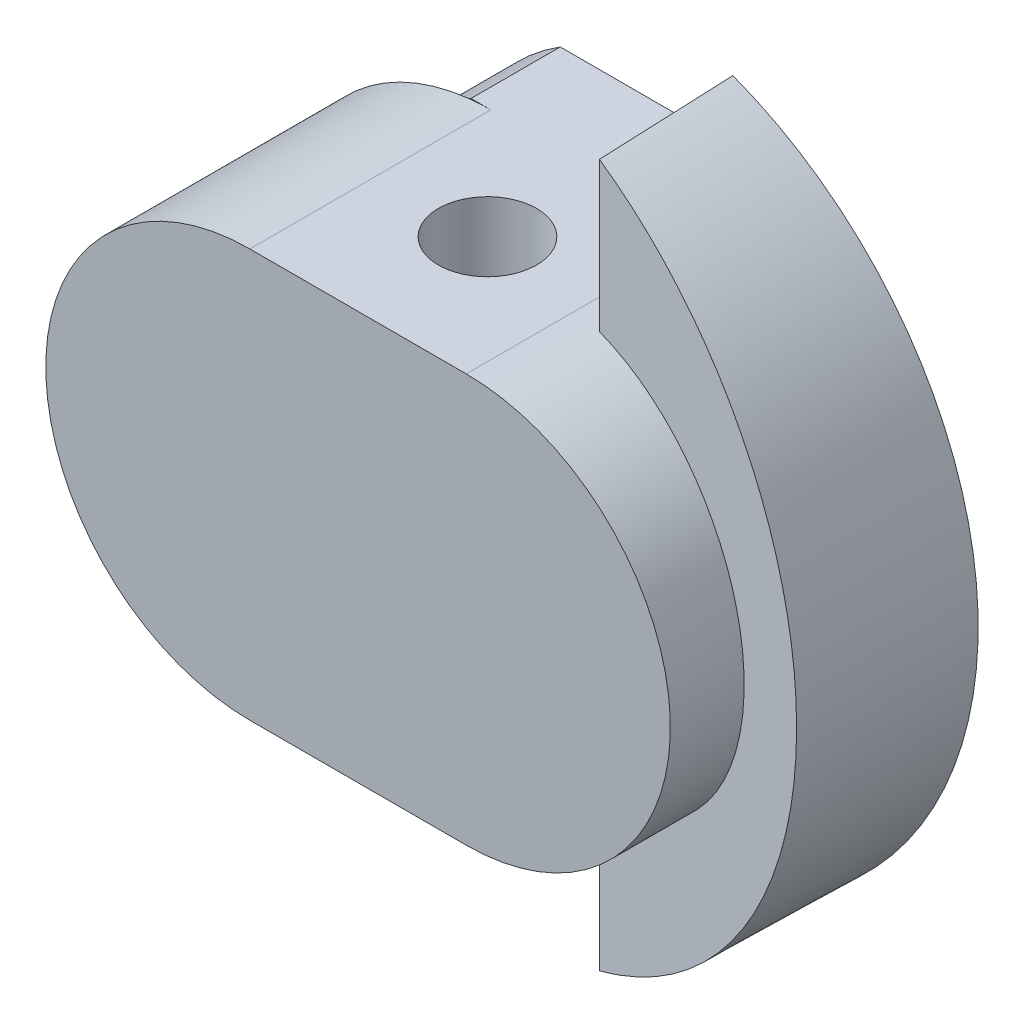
ISO-10303-21;
HEADER;
FILE_DESCRIPTION(('STEP AP214'),'2;1');
FILE_NAME('part.step','',(''),(''),'','','');
FILE_SCHEMA(('AUTOMOTIVE_DESIGN { 1 0 10303 214 1 1 1 1 }'));
ENDSEC;
DATA;
#1=APPLICATION_CONTEXT('core data for automotive mechanical design processes');
#2=APPLICATION_PROTOCOL_DEFINITION('international standard','automotive_design',2000,#1);
#3=PRODUCT_CONTEXT('',#1,'mechanical');
#4=PRODUCT('Part','Part','',(#3));
#5=PRODUCT_RELATED_PRODUCT_CATEGORY('part','',(#4));
#6=PRODUCT_DEFINITION_FORMATION('','',#4);
#7=PRODUCT_DEFINITION_CONTEXT('part definition',#1,'design');
#8=PRODUCT_DEFINITION('design','',#6,#7);
#9=PRODUCT_DEFINITION_SHAPE('','',#8);
#10=(LENGTH_UNIT() NAMED_UNIT(*) SI_UNIT(.MILLI.,.METRE.));
#11=(NAMED_UNIT(*) PLANE_ANGLE_UNIT() SI_UNIT($,.RADIAN.));
#12=(NAMED_UNIT(*) SI_UNIT($,.STERADIAN.) SOLID_ANGLE_UNIT());
#13=UNCERTAINTY_MEASURE_WITH_UNIT(LENGTH_MEASURE(1.E-05),#10,'distance_accuracy_value','');
#14=(GEOMETRIC_REPRESENTATION_CONTEXT(3) GLOBAL_UNCERTAINTY_ASSIGNED_CONTEXT((#13)) GLOBAL_UNIT_ASSIGNED_CONTEXT((#10,
#11,#12)) REPRESENTATION_CONTEXT('',''));
#15=CARTESIAN_POINT('',(0.,0.,0.));
#16=DIRECTION('',(0.,0.,1.));
#17=DIRECTION('',(1.,0.,0.));
#18=AXIS2_PLACEMENT_3D('',#15,#16,#17);
#19=CARTESIAN_POINT('',(7.,12.5329868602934,2.5));
#20=DIRECTION('',(0.,-1.,0.));
#21=DIRECTION('',(0.,0.,-1.));
#22=AXIS2_PLACEMENT_3D('',#19,#20,#21);
#23=CYLINDRICAL_SURFACE('',#22,1.1);
#24=CARTESIAN_POINT('',(7.,6.33,1.4));
#25=CARTESIAN_POINT('',(7.05583436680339,6.32999639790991,1.4000038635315));
#26=CARTESIAN_POINT('',(7.11173177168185,6.32730017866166,1.40427966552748));
#27=CARTESIAN_POINT('',(7.22180743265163,6.31677095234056,1.42115103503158));
#28=CARTESIAN_POINT('',(7.27598236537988,6.30892858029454,1.43376177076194));
#29=CARTESIAN_POINT('',(7.38080678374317,6.28889457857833,1.46656490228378));
#30=CARTESIAN_POINT('',(7.43147225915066,6.276724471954,1.48671980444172));
#31=CARTESIAN_POINT('',(7.52852403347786,6.24904544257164,1.53378351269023));
#32=CARTESIAN_POINT('',(7.57491072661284,6.23353682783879,1.56069169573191));
#33=CARTESIAN_POINT('',(7.66630143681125,6.19898612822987,1.6228802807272));
#34=CARTESIAN_POINT('',(7.71089512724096,6.17976028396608,1.65865955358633));
#35=CARTESIAN_POINT('',(7.79384636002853,6.14026393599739,1.73642516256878));
#36=CARTESIAN_POINT('',(7.8321953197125,6.1199920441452,1.77841989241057));
#37=CARTESIAN_POINT('',(7.90692978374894,6.07735438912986,1.87417313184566));
#38=CARTESIAN_POINT('',(7.94232267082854,6.05508331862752,1.92875515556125));
#39=CARTESIAN_POINT('',(8.00333307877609,6.01428494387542,2.04439346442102));
#40=CARTESIAN_POINT('',(8.02896717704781,5.99575131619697,2.10543854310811));
#41=CARTESIAN_POINT('',(8.06385795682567,5.96962283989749,2.21604228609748));
#42=CARTESIAN_POINT('',(8.07564538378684,5.96043446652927,2.26442356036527));
#43=CARTESIAN_POINT('',(8.09257406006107,5.94707794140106,2.36298488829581));
#44=CARTESIAN_POINT('',(8.09772486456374,5.94290257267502,2.41316224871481));
#45=CARTESIAN_POINT('',(8.10107051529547,5.94020206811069,2.51404425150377));
#46=CARTESIAN_POINT('',(8.0992463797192,5.94169235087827,2.56474995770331));
#47=CARTESIAN_POINT('',(8.08872462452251,5.95011710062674,2.66499531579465));
#48=CARTESIAN_POINT('',(8.08002145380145,5.95705596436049,2.71453399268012));
#49=CARTESIAN_POINT('',(8.05653962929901,5.97514660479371,2.80997341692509));
#50=CARTESIAN_POINT('',(8.04191459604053,5.98619131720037,2.85593347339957));
#51=CARTESIAN_POINT('',(8.00717414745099,6.0112785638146,2.94483823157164));
#52=CARTESIAN_POINT('',(7.98705679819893,6.02532215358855,2.98778186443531));
#53=CARTESIAN_POINT('',(7.93754780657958,6.05801880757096,3.07803983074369));
#54=CARTESIAN_POINT('',(7.90712290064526,6.07704180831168,3.12465303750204));
#55=CARTESIAN_POINT('',(7.83978402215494,6.11583079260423,3.21262636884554));
#56=CARTESIAN_POINT('',(7.80286332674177,6.13559752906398,3.25398097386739));
#57=CARTESIAN_POINT('',(7.71622183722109,6.17756524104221,3.33739179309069));
#58=CARTESIAN_POINT('',(7.66539234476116,6.19961339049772,3.37838652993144));
#59=CARTESIAN_POINT('',(7.55629289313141,6.24024715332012,3.45122686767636));
#60=CARTESIAN_POINT('',(7.4980256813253,6.25883403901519,3.48307583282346));
#61=CARTESIAN_POINT('',(7.37859948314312,6.28960803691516,3.53473015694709));
#62=CARTESIAN_POINT('',(7.31775260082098,6.30207975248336,3.55507971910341));
#63=CARTESIAN_POINT('',(7.19253350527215,6.32052160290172,3.58492218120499));
#64=CARTESIAN_POINT('',(7.12816654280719,6.32650115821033,3.594430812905));
#65=CARTESIAN_POINT('',(7.0082806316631,6.33085115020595,3.60135482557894));
#66=CARTESIAN_POINT('',(6.95288447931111,6.33022938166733,3.60037178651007));
#67=CARTESIAN_POINT('',(6.84316831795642,6.32382349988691,3.59015452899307));
#68=CARTESIAN_POINT('',(6.78884822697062,6.31803978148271,3.58092094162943));
#69=CARTESIAN_POINT('',(6.68506445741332,6.30219670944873,3.55525247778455));
#70=CARTESIAN_POINT('',(6.63549281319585,6.29232444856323,3.53913184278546));
#71=CARTESIAN_POINT('',(6.53981509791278,6.26912861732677,3.50044727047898));
#72=CARTESIAN_POINT('',(6.49370959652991,6.25580448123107,3.47788227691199));
#73=CARTESIAN_POINT('',(6.40124762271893,6.22517460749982,3.42446015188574));
#74=CARTESIAN_POINT('',(6.35533002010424,6.20760352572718,3.39299823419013));
#75=CARTESIAN_POINT('',(6.26910866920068,6.17075492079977,3.32392665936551));
#76=CARTESIAN_POINT('',(6.22881117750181,6.15147553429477,3.28631025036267));
#77=CARTESIAN_POINT('',(6.14882056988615,6.10980783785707,3.19961948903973));
#78=CARTESIAN_POINT('',(6.11008844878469,6.08737940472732,3.14967362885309));
#79=CARTESIAN_POINT('',(6.04140665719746,6.04466192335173,3.04323444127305));
#80=CARTESIAN_POINT('',(6.01145142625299,6.02437152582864,2.98674529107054));
#81=CARTESIAN_POINT('',(5.96661360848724,5.99251801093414,2.88041058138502));
#82=CARTESIAN_POINT('',(5.94989212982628,5.98001748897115,2.83162558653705));
#83=CARTESIAN_POINT('',(5.92334696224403,5.95971056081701,2.73130253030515));
#84=CARTESIAN_POINT('',(5.91351236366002,5.95189673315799,2.67976896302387));
#85=CARTESIAN_POINT('',(5.90128102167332,5.94212450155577,2.57493106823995));
#86=CARTESIAN_POINT('',(5.8989291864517,5.94020145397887,2.52161798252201));
#87=CARTESIAN_POINT('',(5.90197393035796,5.94265970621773,2.41535108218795));
#88=CARTESIAN_POINT('',(5.90737273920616,5.94704282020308,2.36239737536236));
#89=CARTESIAN_POINT('',(5.92474277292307,5.96073428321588,2.2630415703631));
#90=CARTESIAN_POINT('',(5.93611260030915,5.96958949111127,2.21646641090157));
#91=CARTESIAN_POINT('',(5.96447028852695,5.9908475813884,2.12592595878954));
#92=CARTESIAN_POINT('',(5.98146055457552,6.00325198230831,2.08196179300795));
#93=CARTESIAN_POINT('',(6.02333643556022,6.03236548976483,1.99110251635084));
#94=CARTESIAN_POINT('',(6.04900310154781,6.04943637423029,1.94468556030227));
#95=CARTESIAN_POINT('',(6.10640152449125,6.08503297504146,1.85636994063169));
#96=CARTESIAN_POINT('',(6.13813812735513,6.10355984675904,1.8144749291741));
#97=CARTESIAN_POINT('',(6.21427466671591,6.14440369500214,1.72759179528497));
#98=CARTESIAN_POINT('',(6.25993741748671,6.1667264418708,1.6837027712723));
#99=CARTESIAN_POINT('',(6.35878948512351,6.20918472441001,1.60396413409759));
#100=CARTESIAN_POINT('',(6.41198374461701,6.2293188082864,1.56811984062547));
#101=CARTESIAN_POINT('',(6.52534550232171,6.26545720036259,1.50555436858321));
#102=CARTESIAN_POINT('',(6.58555885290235,6.28143186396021,1.4788982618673));
#103=CARTESIAN_POINT('',(6.71089047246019,6.30712711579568,1.43663138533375));
#104=CARTESIAN_POINT('',(6.7759907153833,6.31686953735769,1.42098203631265));
#105=CARTESIAN_POINT('',(6.86825618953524,6.32523276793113,1.40759756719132));
#106=CARTESIAN_POINT('',(6.8944861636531,6.32701522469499,1.40475386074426));
#107=CARTESIAN_POINT('',(6.9471393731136,6.32939972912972,1.40095410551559));
#108=CARTESIAN_POINT('',(6.97356262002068,6.33000170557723,1.39999817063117));
#109=CARTESIAN_POINT('',(7.,6.33,1.4));
#110=B_SPLINE_CURVE_WITH_KNOTS('',3,(#24,#25,#26,#27,#28,#29,#30,#31,#32,#33,#34,#35,#36,#37,
#38,#39,#40,#41,#42,#43,#44,#45,#46,#47,#48,#49,#50,#51,#52,#53,#54,#55,#56,#57,#58,#59,#60,#61,
#62,#63,#64,#65,#66,#67,#68,#69,#70,#71,#72,#73,#74,#75,#76,#77,#78,#79,#80,#81,#82,#83,#84,#85,
#86,#87,#88,#89,#90,#91,#92,#93,#94,#95,#96,#97,#98,#99,#100,#101,#102,#103,#104,#105,#106,#107,
#108,#109),.UNSPECIFIED.,.T.,.F.,(4,2,2,2,2,2,2,2,2,2,2,2,2,2,2,2,2,2,2,2,2,2,2,2,2,2,2,2,2,2,2,
2,2,2,2,2,2,2,2,2,2,2,4),(0.,0.167392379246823,0.335090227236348,0.50196546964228,
0.668825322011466,0.849087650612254,1.02959567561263,1.23488900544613,1.43983202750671,
1.59111546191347,1.74218083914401,1.89365762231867,2.04525676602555,2.19315229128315,
2.3410999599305,2.5169247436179,2.69293258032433,2.89867142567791,3.10433449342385,
3.29920739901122,3.49379715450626,3.6591660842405,3.82452236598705,3.98302704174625,
4.14155771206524,4.31599282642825,4.49062060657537,4.69093777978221,4.89112776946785,
5.04969624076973,5.20801294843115,5.36727802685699,5.52658893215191,5.67227898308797,
5.81803146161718,5.98460017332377,6.15130242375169,6.35185179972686,6.55253340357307,
6.75460838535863,6.95597150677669,7.03522643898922,7.11448615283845),.UNSPECIFIED.);
#111=CARTESIAN_POINT('',(7.,6.33,1.4));
#112=VERTEX_POINT('',#111);
#113=EDGE_CURVE('E38',#112,#112,#110,.T.);
#114=ORIENTED_EDGE('',*,*,#113,.T.);
#115=EDGE_LOOP('',(#114));
#116=FACE_BOUND('',#115,.T.);
#117=CARTESIAN_POINT('',(7.,9.155,2.5));
#118=DIRECTION('',(0.,-1.,0.));
#119=DIRECTION('',(0.,0.,-1.));
#120=AXIS2_PLACEMENT_3D('',#117,#118,#119);
#121=CIRCLE('',#120,1.1);
#122=CARTESIAN_POINT('',(7.,9.155,1.4));
#123=VERTEX_POINT('',#122);
#124=EDGE_CURVE('E150',#123,#123,#121,.T.);
#125=ORIENTED_EDGE('',*,*,#124,.F.);
#126=EDGE_LOOP('',(#125));
#127=FACE_BOUND('',#126,.T.);
#128=ADVANCED_FACE('F33',(#116,#127),#23,.F.);
#129=CARTESIAN_POINT('',(7.,4.58,0.));
#130=DIRECTION('',(0.,0.,1.));
#131=DIRECTION('',(1.,0.,0.));
#132=AXIS2_PLACEMENT_3D('',#129,#130,#131);
#133=PLANE('',#132);
#134=CARTESIAN_POINT('',(7.,4.58,0.));
#135=DIRECTION('',(0.,0.,-1.));
#136=DIRECTION('',(-1.,0.,0.));
#137=AXIS2_PLACEMENT_3D('',#134,#135,#136);
#138=CIRCLE('',#137,5.4);
#139=CARTESIAN_POINT('',(9.90927835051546,9.12929659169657,0.));
#140=VERTEX_POINT('',#139);
#141=CARTESIAN_POINT('',(9.90927835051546,0.0307034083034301,0.));
#142=VERTEX_POINT('',#141);
#143=EDGE_CURVE('E11',#140,#142,#138,.T.);
#144=ORIENTED_EDGE('',*,*,#143,.F.);
#145=CARTESIAN_POINT('',(9.425,4.58,0.));
#146=DIRECTION('',(0.,0.,1.));
#147=DIRECTION('',(1.,0.,0.));
#148=AXIS2_PLACEMENT_3D('',#145,#146,#147);
#149=CIRCLE('',#148,4.575);
#150=CARTESIAN_POINT('',(10.,9.11872228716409,0.));
#151=VERTEX_POINT('',#150);
#152=EDGE_CURVE('E215',#151,#140,#149,.T.);
#153=ORIENTED_EDGE('',*,*,#152,.F.);
#154=DIRECTION('',(0.,-1.,0.));
#155=VECTOR('',#154,1.);
#156=CARTESIAN_POINT('',(10.,12.5329868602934,0.));
#157=LINE('',#156,#155);
#158=CARTESIAN_POINT('',(10.,12.5329868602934,0.));
#159=VERTEX_POINT('',#158);
#160=EDGE_CURVE('E278',#159,#151,#157,.T.);
#161=ORIENTED_EDGE('',*,*,#160,.F.);
#162=CARTESIAN_POINT('',(7.,4.58,0.));
#163=DIRECTION('',(0.,0.,1.));
#164=DIRECTION('',(1.,0.,0.));
#165=AXIS2_PLACEMENT_3D('',#162,#163,#164);
#166=CIRCLE('',#165,8.5);
#167=CARTESIAN_POINT('',(10.,-3.37298686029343,0.));
#168=VERTEX_POINT('',#167);
#169=EDGE_CURVE('E274',#168,#159,#166,.T.);
#170=ORIENTED_EDGE('',*,*,#169,.F.);
#171=CARTESIAN_POINT('',(10.,0.0412777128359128,0.));
#172=VERTEX_POINT('',#171);
#173=EDGE_CURVE('E277',#172,#168,#157,.T.);
#174=ORIENTED_EDGE('',*,*,#173,.F.);
#175=EDGE_CURVE('E225',#142,#172,#149,.T.);
#176=ORIENTED_EDGE('',*,*,#175,.F.);
#177=EDGE_LOOP('',(#144,#153,#161,#170,#174,#176));
#178=FACE_BOUND('',#177,.T.);
#179=ADVANCED_FACE('F290',(#178),#133,.F.);
#180=CARTESIAN_POINT('',(7.,4.58,0.));
#181=DIRECTION('',(0.,0.,-1.));
#182=DIRECTION('',(-1.,0.,0.));
#183=AXIS2_PLACEMENT_3D('',#180,#181,#182);
#184=CIRCLE('',#183,5.4);
#185=CARTESIAN_POINT('',(4.09072164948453,0.030703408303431,0.));
#186=VERTEX_POINT('',#185);
#187=CARTESIAN_POINT('',(4.09072164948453,9.12929659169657,0.));
#188=VERTEX_POINT('',#187);
#189=EDGE_CURVE('E47',#186,#188,#184,.T.);
#190=ORIENTED_EDGE('',*,*,#189,.F.);
#191=CARTESIAN_POINT('',(4.575,4.58,0.));
#192=DIRECTION('',(0.,0.,1.));
#193=DIRECTION('',(1.,0.,0.));
#194=AXIS2_PLACEMENT_3D('',#191,#192,#193);
#195=CIRCLE('',#194,4.575);
#196=EDGE_CURVE('E169',#188,#186,#195,.T.);
#197=ORIENTED_EDGE('',*,*,#196,.F.);
#198=EDGE_LOOP('',(#190,#197));
#199=FACE_BOUND('',#198,.T.);
#200=ADVANCED_FACE('F294',(#199),#133,.F.);
#201=CARTESIAN_POINT('',(7.,37.2897884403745,2.5));
#202=DIRECTION('',(0.175180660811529,0.,-0.984536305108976));
#203=DIRECTION('',(-0.984536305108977,0.,-0.175180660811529));
#204=AXIS2_PLACEMENT_3D('',#201,#202,#203);
#205=PLANE('',#204);
#206=CARTESIAN_POINT('',(9.425,4.58,2.93148546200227));
#207=DIRECTION('',(0.175180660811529,0.,-0.984536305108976));
#208=DIRECTION('',(-0.984536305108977,0.,-0.175180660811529));
#209=AXIS2_PLACEMENT_3D('',#206,#207,#208);
#210=ELLIPSE('',#209,4.64685758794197,4.575);
#211=CARTESIAN_POINT('',(10.0531200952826,0.0483236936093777,3.04324822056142));
#212=VERTEX_POINT('',#211);
#213=CARTESIAN_POINT('',(10.0531200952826,9.11167630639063,3.04324822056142));
#214=VERTEX_POINT('',#213);
#215=EDGE_CURVE('E264',#212,#214,#210,.F.);
#216=ORIENTED_EDGE('',*,*,#215,.F.);
#217=DIRECTION('',(0.,-1.,0.));
#218=VECTOR('',#217,1.);
#219=CARTESIAN_POINT('',(10.0531200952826,12.5329868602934,3.04324822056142));
#220=LINE('',#219,#218);
#221=CARTESIAN_POINT('',(10.0531200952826,-3.29580077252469,3.04324822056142));
#222=VERTEX_POINT('',#221);
#223=EDGE_CURVE('E268',#222,#212,#220,.F.);
#224=ORIENTED_EDGE('',*,*,#223,.F.);
#225=CARTESIAN_POINT('',(6.97373583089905,4.58,2.49532675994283));
#226=DIRECTION('',(0.175180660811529,0.,-0.984536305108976));
#227=DIRECTION('',(-0.984536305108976,0.,-0.175180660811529));
#228=AXIS2_PLACEMENT_3D('',#225,#226,#227);
#229=ELLIPSE('',#228,8.58926569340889,8.45640312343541);
#230=CARTESIAN_POINT('',(10.0531200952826,12.4558007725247,3.04324822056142));
#231=VERTEX_POINT('',#230);
#232=EDGE_CURVE('E271',#231,#222,#229,.T.);
#233=ORIENTED_EDGE('',*,*,#232,.F.);
#234=EDGE_CURVE('E272',#214,#231,#220,.F.);
#235=ORIENTED_EDGE('',*,*,#234,.F.);
#236=EDGE_LOOP('',(#216,#224,#233,#235));
#237=FACE_BOUND('',#236,.T.);
#238=ADVANCED_FACE('F288',(#237),#205,.F.);
#239=CARTESIAN_POINT('',(10.,12.5329868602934,0.));
#240=DIRECTION('',(-0.999847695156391,0.,0.0174524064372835));
#241=DIRECTION('',(0.0174524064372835,0.,0.999847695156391));
#242=AXIS2_PLACEMENT_3D('',#239,#240,#241);
#243=PLANE('',#242);
#244=CARTESIAN_POINT('',(9.425,4.58,-32.9417279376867));
#245=DIRECTION('',(-0.999847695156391,0.,0.0174524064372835));
#246=DIRECTION('',(-0.0174524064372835,0.,-0.999847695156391));
#247=AXIS2_PLACEMENT_3D('',#244,#245,#246);
#248=ELLIPSE('',#247,262.141499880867,4.575);
#249=EDGE_CURVE('E265',#172,#212,#248,.T.);
#250=ORIENTED_EDGE('',*,*,#249,.F.);
#251=ORIENTED_EDGE('',*,*,#173,.T.);
#252=CARTESIAN_POINT('',(10.0698202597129,-3.27137784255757,4.));
#253=CARTESIAN_POINT('',(10.05818359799,-3.28842148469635,3.33333609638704));
#254=CARTESIAN_POINT('',(10.0465469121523,-3.30541072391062,2.66667081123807));
#255=CARTESIAN_POINT('',(10.0232734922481,-3.33928039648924,1.33333747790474));
#256=CARTESIAN_POINT('',(10.0116367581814,-3.35616082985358,0.666669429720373));
#257=CARTESIAN_POINT('',(10.,-3.37298686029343,0.));
#258=B_SPLINE_CURVE_WITH_KNOTS('',3,(#252,#253,#254,#255,#256,#257),.UNSPECIFIED.,.F.,.F.,(4,2,
4),(0.,2.00094973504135,4.00189946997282),.UNSPECIFIED.);
#259=EDGE_CURVE('E231',#222,#168,#258,.T.);
#260=ORIENTED_EDGE('',*,*,#259,.F.);
#261=ORIENTED_EDGE('',*,*,#223,.T.);
#262=EDGE_LOOP('',(#250,#251,#260,#261));
#263=FACE_BOUND('',#262,.T.);
#264=ADVANCED_FACE('F283',(#263),#243,.T.);
#265=EDGE_CURVE('E238',#214,#151,#248,.T.);
#266=ORIENTED_EDGE('',*,*,#265,.F.);
#267=ORIENTED_EDGE('',*,*,#234,.T.);
#268=CARTESIAN_POINT('',(10.0698202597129,12.4313778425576,4.));
#269=CARTESIAN_POINT('',(10.05818359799,12.4484214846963,3.33333609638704));
#270=CARTESIAN_POINT('',(10.0465469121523,12.4654107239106,2.66667081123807));
#271=CARTESIAN_POINT('',(10.0232734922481,12.4992803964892,1.33333747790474));
#272=CARTESIAN_POINT('',(10.0116367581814,12.5161608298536,0.666669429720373));
#273=CARTESIAN_POINT('',(10.,12.5329868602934,0.));
#274=B_SPLINE_CURVE_WITH_KNOTS('',3,(#268,#269,#270,#271,#272,#273),.UNSPECIFIED.,.F.,.F.,(4,2,
4),(0.,2.00094973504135,4.00189946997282),.UNSPECIFIED.);
#275=EDGE_CURVE('E279',#231,#159,#274,.T.);
#276=ORIENTED_EDGE('',*,*,#275,.T.);
#277=ORIENTED_EDGE('',*,*,#160,.T.);
#278=EDGE_LOOP('',(#266,#267,#276,#277));
#279=FACE_BOUND('',#278,.T.);
#280=ADVANCED_FACE('F287',(#279),#243,.T.);
#281=CARTESIAN_POINT('',(7.,4.58,0.));
#282=DIRECTION('',(0.,0.,-1.));
#283=DIRECTION('',(1.,0.,0.));
#284=AXIS2_PLACEMENT_3D('',#281,#282,#283);
#285=CONICAL_SURFACE('',#284,8.5,0.0174532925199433);
#286=ORIENTED_EDGE('',*,*,#275,.F.);
#287=ORIENTED_EDGE('',*,*,#232,.T.);
#288=ORIENTED_EDGE('',*,*,#259,.T.);
#289=ORIENTED_EDGE('',*,*,#169,.T.);
#290=EDGE_LOOP('',(#286,#287,#288,#289));
#291=FACE_BOUND('',#290,.T.);
#292=ADVANCED_FACE('F35',(#291),#285,.T.);
#293=CARTESIAN_POINT('',(9.425,4.58,5.4));
#294=DIRECTION('',(0.,0.,-1.));
#295=DIRECTION('',(-1.,0.,0.));
#296=AXIS2_PLACEMENT_3D('',#293,#294,#295);
#297=CYLINDRICAL_SURFACE('',#296,4.575);
#298=CARTESIAN_POINT('',(9.425,0.0049999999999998,0.));
#299=VERTEX_POINT('',#298);
#300=EDGE_CURVE('E155',#299,#142,#149,.T.);
#301=ORIENTED_EDGE('',*,*,#300,.T.);
#302=ORIENTED_EDGE('',*,*,#175,.T.);
#303=ORIENTED_EDGE('',*,*,#249,.T.);
#304=ORIENTED_EDGE('',*,*,#215,.T.);
#305=ORIENTED_EDGE('',*,*,#265,.T.);
#306=ORIENTED_EDGE('',*,*,#152,.T.);
#307=CARTESIAN_POINT('',(9.425,9.155,0.));
#308=VERTEX_POINT('',#307);
#309=EDGE_CURVE('E213',#140,#308,#149,.T.);
#310=ORIENTED_EDGE('',*,*,#309,.T.);
#311=DIRECTION('',(0.,0.,-1.));
#312=VECTOR('',#311,1.);
#313=CARTESIAN_POINT('',(9.425,9.155,5.4));
#314=LINE('',#313,#312);
#315=CARTESIAN_POINT('',(9.425,9.155,5.4));
#316=VERTEX_POINT('',#315);
#317=EDGE_CURVE('E243',#316,#308,#314,.T.);
#318=ORIENTED_EDGE('',*,*,#317,.F.);
#319=CARTESIAN_POINT('',(9.425,4.58,5.4));
#320=DIRECTION('',(0.,0.,1.));
#321=DIRECTION('',(1.,0.,0.));
#322=AXIS2_PLACEMENT_3D('',#319,#320,#321);
#323=CIRCLE('',#322,4.575);
#324=CARTESIAN_POINT('',(9.425,0.0049999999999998,5.4));
#325=VERTEX_POINT('',#324);
#326=EDGE_CURVE('E253',#325,#316,#323,.T.);
#327=ORIENTED_EDGE('',*,*,#326,.F.);
#328=DIRECTION('',(0.,0.,-1.));
#329=VECTOR('',#328,1.);
#330=CARTESIAN_POINT('',(9.425,0.0049999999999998,5.4));
#331=LINE('',#330,#329);
#332=EDGE_CURVE('E239',#325,#299,#331,.T.);
#333=ORIENTED_EDGE('',*,*,#332,.T.);
#334=EDGE_LOOP('',(#301,#302,#303,#304,#305,#306,#310,#318,#327,#333));
#335=FACE_BOUND('',#334,.T.);
#336=ADVANCED_FACE('F301',(#335),#297,.T.);
#337=CARTESIAN_POINT('',(4.575,4.58,5.4));
#338=DIRECTION('',(0.,0.,-1.));
#339=DIRECTION('',(-1.,0.,0.));
#340=AXIS2_PLACEMENT_3D('',#337,#338,#339);
#341=CYLINDRICAL_SURFACE('',#340,4.575);
#342=CARTESIAN_POINT('',(4.575,9.155,0.));
#343=VERTEX_POINT('',#342);
#344=EDGE_CURVE('E211',#343,#188,#195,.T.);
#345=ORIENTED_EDGE('',*,*,#344,.T.);
#346=ORIENTED_EDGE('',*,*,#196,.T.);
#347=CARTESIAN_POINT('',(4.575,0.0049999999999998,0.));
#348=VERTEX_POINT('',#347);
#349=EDGE_CURVE('E166',#186,#348,#195,.T.);
#350=ORIENTED_EDGE('',*,*,#349,.T.);
#351=DIRECTION('',(0.,0.,-1.));
#352=VECTOR('',#351,1.);
#353=CARTESIAN_POINT('',(4.575,0.0049999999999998,5.4));
#354=LINE('',#353,#352);
#355=CARTESIAN_POINT('',(4.575,0.0049999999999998,5.4));
#356=VERTEX_POINT('',#355);
#357=EDGE_CURVE('E236',#356,#348,#354,.T.);
#358=ORIENTED_EDGE('',*,*,#357,.F.);
#359=CARTESIAN_POINT('',(4.575,4.58,5.4));
#360=DIRECTION('',(0.,0.,1.));
#361=DIRECTION('',(1.,0.,0.));
#362=AXIS2_PLACEMENT_3D('',#359,#360,#361);
#363=CIRCLE('',#362,4.575);
#364=CARTESIAN_POINT('',(4.575,9.155,5.4));
#365=VERTEX_POINT('',#364);
#366=EDGE_CURVE('E246',#365,#356,#363,.T.);
#367=ORIENTED_EDGE('',*,*,#366,.F.);
#368=DIRECTION('',(0.,0.,-1.));
#369=VECTOR('',#368,1.);
#370=CARTESIAN_POINT('',(4.575,9.155,5.4));
#371=LINE('',#370,#369);
#372=EDGE_CURVE('E249',#365,#343,#371,.T.);
#373=ORIENTED_EDGE('',*,*,#372,.T.);
#374=EDGE_LOOP('',(#345,#346,#350,#358,#367,#373));
#375=FACE_BOUND('',#374,.T.);
#376=ADVANCED_FACE('F298',(#375),#341,.T.);
#377=CARTESIAN_POINT('',(4.575,0.0049999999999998,5.4));
#378=DIRECTION('',(0.,1.,0.));
#379=DIRECTION('',(0.,0.,1.));
#380=AXIS2_PLACEMENT_3D('',#377,#378,#379);
#381=PLANE('',#380);
#382=CARTESIAN_POINT('',(7.,0.0049999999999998,2.5));
#383=DIRECTION('',(0.,-1.,0.));
#384=DIRECTION('',(0.,0.,-1.));
#385=AXIS2_PLACEMENT_3D('',#382,#383,#384);
#386=CIRCLE('',#385,1.1);
#387=CARTESIAN_POINT('',(7.,0.0049999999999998,1.4));
#388=VERTEX_POINT('',#387);
#389=EDGE_CURVE('E342',#388,#388,#386,.T.);
#390=ORIENTED_EDGE('',*,*,#389,.F.);
#391=EDGE_LOOP('',(#390));
#392=FACE_BOUND('',#391,.T.);
#393=ORIENTED_EDGE('',*,*,#357,.T.);
#394=DIRECTION('',(-1.,0.,0.));
#395=VECTOR('',#394,1.);
#396=CARTESIAN_POINT('',(9.86868872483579,0.0049999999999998,0.));
#397=LINE('',#396,#395);
#398=CARTESIAN_POINT('',(4.13131127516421,0.0049999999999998,0.));
#399=VERTEX_POINT('',#398);
#400=EDGE_CURVE('E159',#348,#399,#397,.T.);
#401=ORIENTED_EDGE('',*,*,#400,.T.);
#402=DIRECTION('',(0.,0.,1.));
#403=VECTOR('',#402,1.);
#404=CARTESIAN_POINT('',(4.13131127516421,0.0049999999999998,-2.));
#405=LINE('',#404,#403);
#406=CARTESIAN_POINT('',(4.13131127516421,0.0049999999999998,-2.));
#407=VERTEX_POINT('',#406);
#408=EDGE_CURVE('E167',#407,#399,#405,.T.);
#409=ORIENTED_EDGE('',*,*,#408,.F.);
#410=DIRECTION('',(-1.,0.,0.));
#411=VECTOR('',#410,1.);
#412=CARTESIAN_POINT('',(9.86868872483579,0.0049999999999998,-2.));
#413=LINE('',#412,#411);
#414=CARTESIAN_POINT('',(9.86868872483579,0.0049999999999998,-2.));
#415=VERTEX_POINT('',#414);
#416=EDGE_CURVE('E164',#415,#407,#413,.T.);
#417=ORIENTED_EDGE('',*,*,#416,.F.);
#418=DIRECTION('',(0.,0.,1.));
#419=VECTOR('',#418,1.);
#420=CARTESIAN_POINT('',(9.86868872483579,0.0049999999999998,-2.));
#421=LINE('',#420,#419);
#422=CARTESIAN_POINT('',(9.86868872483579,0.0049999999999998,0.));
#423=VERTEX_POINT('',#422);
#424=EDGE_CURVE('E147',#415,#423,#421,.T.);
#425=ORIENTED_EDGE('',*,*,#424,.T.);
#426=EDGE_CURVE('E152',#423,#299,#397,.T.);
#427=ORIENTED_EDGE('',*,*,#426,.T.);
#428=ORIENTED_EDGE('',*,*,#332,.F.);
#429=DIRECTION('',(1.,0.,0.));
#430=VECTOR('',#429,1.);
#431=CARTESIAN_POINT('',(4.575,0.0049999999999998,5.4));
#432=LINE('',#431,#430);
#433=EDGE_CURVE('E258',#356,#325,#432,.T.);
#434=ORIENTED_EDGE('',*,*,#433,.F.);
#435=EDGE_LOOP('',(#393,#401,#409,#417,#425,#427,#428,#434));
#436=FACE_BOUND('',#435,.T.);
#437=ADVANCED_FACE('F162',(#392,#436),#381,.F.);
#438=CARTESIAN_POINT('',(4.575,9.155,5.4));
#439=DIRECTION('',(0.,-1.,0.));
#440=DIRECTION('',(0.,0.,-1.));
#441=AXIS2_PLACEMENT_3D('',#438,#439,#440);
#442=PLANE('',#441);
#443=ORIENTED_EDGE('',*,*,#124,.T.);
#444=EDGE_LOOP('',(#443));
#445=FACE_BOUND('',#444,.T.);
#446=ORIENTED_EDGE('',*,*,#317,.T.);
#447=DIRECTION('',(1.,0.,0.));
#448=VECTOR('',#447,1.);
#449=CARTESIAN_POINT('',(9.86868872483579,9.155,0.));
#450=LINE('',#449,#448);
#451=CARTESIAN_POINT('',(9.86868872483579,9.155,0.));
#452=VERTEX_POINT('',#451);
#453=EDGE_CURVE('E181',#308,#452,#450,.T.);
#454=ORIENTED_EDGE('',*,*,#453,.T.);
#455=DIRECTION('',(0.,0.,1.));
#456=VECTOR('',#455,1.);
#457=CARTESIAN_POINT('',(9.86868872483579,9.155,-2.));
#458=LINE('',#457,#456);
#459=CARTESIAN_POINT('',(9.86868872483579,9.155,-2.));
#460=VERTEX_POINT('',#459);
#461=EDGE_CURVE('E194',#460,#452,#458,.T.);
#462=ORIENTED_EDGE('',*,*,#461,.F.);
#463=DIRECTION('',(1.,0.,0.));
#464=VECTOR('',#463,1.);
#465=CARTESIAN_POINT('',(9.86868872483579,9.155,-2.));
#466=LINE('',#465,#464);
#467=CARTESIAN_POINT('',(4.13131127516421,9.155,-2.));
#468=VERTEX_POINT('',#467);
#469=EDGE_CURVE('E192',#468,#460,#466,.T.);
#470=ORIENTED_EDGE('',*,*,#469,.F.);
#471=DIRECTION('',(0.,0.,1.));
#472=VECTOR('',#471,1.);
#473=CARTESIAN_POINT('',(4.13131127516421,9.155,-2.));
#474=LINE('',#473,#472);
#475=CARTESIAN_POINT('',(4.13131127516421,9.155,0.));
#476=VERTEX_POINT('',#475);
#477=EDGE_CURVE('E172',#468,#476,#474,.T.);
#478=ORIENTED_EDGE('',*,*,#477,.T.);
#479=EDGE_CURVE('E176',#476,#343,#450,.T.);
#480=ORIENTED_EDGE('',*,*,#479,.T.);
#481=ORIENTED_EDGE('',*,*,#372,.F.);
#482=DIRECTION('',(-1.,0.,0.));
#483=VECTOR('',#482,1.);
#484=CARTESIAN_POINT('',(4.575,9.155,5.4));
#485=LINE('',#484,#483);
#486=EDGE_CURVE('E251',#316,#365,#485,.T.);
#487=ORIENTED_EDGE('',*,*,#486,.F.);
#488=EDGE_LOOP('',(#446,#454,#462,#470,#478,#480,#481,#487));
#489=FACE_BOUND('',#488,.T.);
#490=ADVANCED_FACE('F202',(#445,#489),#442,.F.);
#491=CARTESIAN_POINT('',(4.575,4.58,5.4));
#492=DIRECTION('',(0.,0.,1.));
#493=DIRECTION('',(1.,0.,0.));
#494=AXIS2_PLACEMENT_3D('',#491,#492,#493);
#495=PLANE('',#494);
#496=ORIENTED_EDGE('',*,*,#366,.T.);
#497=ORIENTED_EDGE('',*,*,#433,.T.);
#498=ORIENTED_EDGE('',*,*,#326,.T.);
#499=ORIENTED_EDGE('',*,*,#486,.T.);
#500=EDGE_LOOP('',(#496,#497,#498,#499));
#501=FACE_BOUND('',#500,.T.);
#502=ADVANCED_FACE('F310',(#501),#495,.T.);
#503=CARTESIAN_POINT('',(7.,4.58,0.));
#504=DIRECTION('',(0.,0.,-1.));
#505=DIRECTION('',(-1.,0.,0.));
#506=AXIS2_PLACEMENT_3D('',#503,#504,#505);
#507=PLANE('',#506);
#508=ORIENTED_EDGE('',*,*,#300,.F.);
#509=ORIENTED_EDGE('',*,*,#426,.F.);
#510=EDGE_CURVE('E50',#142,#423,#138,.T.);
#511=ORIENTED_EDGE('',*,*,#510,.F.);
#512=EDGE_LOOP('',(#508,#509,#511));
#513=FACE_BOUND('',#512,.T.);
#514=ADVANCED_FACE('F153',(#513),#507,.F.);
#515=ORIENTED_EDGE('',*,*,#344,.F.);
#516=ORIENTED_EDGE('',*,*,#479,.F.);
#517=EDGE_CURVE('E158',#188,#476,#184,.T.);
#518=ORIENTED_EDGE('',*,*,#517,.F.);
#519=EDGE_LOOP('',(#515,#516,#518));
#520=FACE_BOUND('',#519,.T.);
#521=ADVANCED_FACE('F210',(#520),#507,.F.);
#522=ORIENTED_EDGE('',*,*,#349,.F.);
#523=EDGE_CURVE('E185',#399,#186,#184,.T.);
#524=ORIENTED_EDGE('',*,*,#523,.F.);
#525=ORIENTED_EDGE('',*,*,#400,.F.);
#526=EDGE_LOOP('',(#522,#524,#525));
#527=FACE_BOUND('',#526,.T.);
#528=ADVANCED_FACE('F317',(#527),#507,.F.);
#529=CARTESIAN_POINT('',(7.,4.58,-2.));
#530=DIRECTION('',(0.,0.,1.));
#531=DIRECTION('',(1.,0.,0.));
#532=AXIS2_PLACEMENT_3D('',#529,#530,#531);
#533=CYLINDRICAL_SURFACE('',#532,5.4);
#534=EDGE_CURVE('E49',#452,#140,#138,.T.);
#535=ORIENTED_EDGE('',*,*,#534,.T.);
#536=ORIENTED_EDGE('',*,*,#143,.T.);
#537=ORIENTED_EDGE('',*,*,#510,.T.);
#538=ORIENTED_EDGE('',*,*,#424,.F.);
#539=CARTESIAN_POINT('',(7.,4.58,-2.));
#540=DIRECTION('',(0.,0.,-1.));
#541=DIRECTION('',(-1.,0.,0.));
#542=AXIS2_PLACEMENT_3D('',#539,#540,#541);
#543=CIRCLE('',#542,5.4);
#544=EDGE_CURVE('E180',#460,#415,#543,.T.);
#545=ORIENTED_EDGE('',*,*,#544,.F.);
#546=ORIENTED_EDGE('',*,*,#461,.T.);
#547=EDGE_LOOP('',(#535,#536,#537,#538,#545,#546));
#548=FACE_BOUND('',#547,.T.);
#549=ADVANCED_FACE('F144',(#548),#533,.T.);
#550=CARTESIAN_POINT('',(7.,4.58,-2.));
#551=DIRECTION('',(0.,0.,1.));
#552=DIRECTION('',(1.,0.,0.));
#553=AXIS2_PLACEMENT_3D('',#550,#551,#552);
#554=CYLINDRICAL_SURFACE('',#553,5.4);
#555=ORIENTED_EDGE('',*,*,#523,.T.);
#556=ORIENTED_EDGE('',*,*,#189,.T.);
#557=ORIENTED_EDGE('',*,*,#517,.T.);
#558=ORIENTED_EDGE('',*,*,#477,.F.);
#559=CARTESIAN_POINT('',(7.,4.58,-2.));
#560=DIRECTION('',(0.,0.,-1.));
#561=DIRECTION('',(-1.,0.,0.));
#562=AXIS2_PLACEMENT_3D('',#559,#560,#561);
#563=CIRCLE('',#562,5.4);
#564=EDGE_CURVE('E190',#407,#468,#563,.T.);
#565=ORIENTED_EDGE('',*,*,#564,.F.);
#566=ORIENTED_EDGE('',*,*,#408,.T.);
#567=EDGE_LOOP('',(#555,#556,#557,#558,#565,#566));
#568=FACE_BOUND('',#567,.T.);
#569=ADVANCED_FACE('F316',(#568),#554,.T.);
#570=CARTESIAN_POINT('',(7.,4.58,-2.));
#571=DIRECTION('',(0.,0.,-1.));
#572=DIRECTION('',(-1.,0.,0.));
#573=AXIS2_PLACEMENT_3D('',#570,#571,#572);
#574=PLANE('',#573);
#575=CARTESIAN_POINT('',(7.,4.58,-2.));
#576=DIRECTION('',(0.,0.,-1.));
#577=DIRECTION('',(-1.,0.,0.));
#578=AXIS2_PLACEMENT_3D('',#575,#576,#577);
#579=CIRCLE('',#578,1.75);
#580=CARTESIAN_POINT('',(5.25,4.58,-2.));
#581=VERTEX_POINT('',#580);
#582=EDGE_CURVE('E344',#581,#581,#579,.T.);
#583=ORIENTED_EDGE('',*,*,#582,.F.);
#584=EDGE_LOOP('',(#583));
#585=FACE_BOUND('',#584,.T.);
#586=ORIENTED_EDGE('',*,*,#544,.T.);
#587=ORIENTED_EDGE('',*,*,#416,.T.);
#588=ORIENTED_EDGE('',*,*,#564,.T.);
#589=ORIENTED_EDGE('',*,*,#469,.T.);
#590=EDGE_LOOP('',(#586,#587,#588,#589));
#591=FACE_BOUND('',#590,.T.);
#592=ADVANCED_FACE('F320',(#585,#591),#574,.T.);
#593=ORIENTED_EDGE('',*,*,#309,.F.);
#594=ORIENTED_EDGE('',*,*,#534,.F.);
#595=ORIENTED_EDGE('',*,*,#453,.F.);
#596=EDGE_LOOP('',(#593,#594,#595));
#597=FACE_BOUND('',#596,.T.);
#598=ADVANCED_FACE('F323',(#597),#507,.F.);
#599=CARTESIAN_POINT('',(7.,2.83,1.4));
#600=CARTESIAN_POINT('',(6.94416563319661,2.83000360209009,1.4000038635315));
#601=CARTESIAN_POINT('',(6.88826822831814,2.83269982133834,1.40427966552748));
#602=CARTESIAN_POINT('',(6.77819256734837,2.84322904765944,1.42115103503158));
#603=CARTESIAN_POINT('',(6.72401763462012,2.85107141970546,1.43376177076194));
#604=CARTESIAN_POINT('',(6.61919321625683,2.87110542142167,1.46656490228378));
#605=CARTESIAN_POINT('',(6.56852774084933,2.883275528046,1.48671980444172));
#606=CARTESIAN_POINT('',(6.47147596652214,2.91095455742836,1.53378351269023));
#607=CARTESIAN_POINT('',(6.42508927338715,2.92646317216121,1.56069169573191));
#608=CARTESIAN_POINT('',(6.33369856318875,2.96101387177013,1.6228802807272));
#609=CARTESIAN_POINT('',(6.28910487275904,2.98023971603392,1.65865955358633));
#610=CARTESIAN_POINT('',(6.20615363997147,3.01973606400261,1.73642516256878));
#611=CARTESIAN_POINT('',(6.16780468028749,3.0400079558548,1.77841989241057));
#612=CARTESIAN_POINT('',(6.09307021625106,3.08264561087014,1.87417313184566));
#613=CARTESIAN_POINT('',(6.05767732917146,3.10491668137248,1.92875515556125));
#614=CARTESIAN_POINT('',(5.9966669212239,3.14571505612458,2.04439346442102));
#615=CARTESIAN_POINT('',(5.97103282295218,3.16424868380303,2.1054385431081));
#616=CARTESIAN_POINT('',(5.93614204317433,3.19037716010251,2.21604228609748));
#617=CARTESIAN_POINT('',(5.92435461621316,3.19956553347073,2.26442356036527));
#618=CARTESIAN_POINT('',(5.90742593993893,3.21292205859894,2.36298488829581));
#619=CARTESIAN_POINT('',(5.90227513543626,3.21709742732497,2.41316224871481));
#620=CARTESIAN_POINT('',(5.89892948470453,3.21979793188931,2.51404425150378));
#621=CARTESIAN_POINT('',(5.9007536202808,3.21830764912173,2.56474995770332));
#622=CARTESIAN_POINT('',(5.91127537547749,3.20988289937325,2.66499531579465));
#623=CARTESIAN_POINT('',(5.91997854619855,3.20294403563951,2.71453399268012));
#624=CARTESIAN_POINT('',(5.94346037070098,3.18485339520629,2.80997341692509));
#625=CARTESIAN_POINT('',(5.95808540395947,3.17380868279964,2.85593347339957));
#626=CARTESIAN_POINT('',(5.99282585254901,3.1487214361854,2.94483823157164));
#627=CARTESIAN_POINT('',(6.01294320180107,3.13467784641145,2.98778186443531));
#628=CARTESIAN_POINT('',(6.06245219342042,3.10198119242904,3.07803983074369));
#629=CARTESIAN_POINT('',(6.09287709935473,3.08295819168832,3.12465303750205));
#630=CARTESIAN_POINT('',(6.16021597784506,3.04416920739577,3.21262636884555));
#631=CARTESIAN_POINT('',(6.19713667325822,3.02440247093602,3.25398097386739));
#632=CARTESIAN_POINT('',(6.28377816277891,2.98243475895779,3.33739179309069));
#633=CARTESIAN_POINT('',(6.33460765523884,2.96038660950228,3.37838652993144));
#634=CARTESIAN_POINT('',(6.44370710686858,2.91975284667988,3.45122686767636));
#635=CARTESIAN_POINT('',(6.5019743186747,2.90116596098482,3.48307583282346));
#636=CARTESIAN_POINT('',(6.62140051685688,2.87039196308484,3.53473015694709));
#637=CARTESIAN_POINT('',(6.68224739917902,2.85792024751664,3.55507971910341));
#638=CARTESIAN_POINT('',(6.80746649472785,2.83947839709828,3.58492218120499));
#639=CARTESIAN_POINT('',(6.8718334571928,2.83349884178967,3.594430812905));
#640=CARTESIAN_POINT('',(6.9917193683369,2.82914884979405,3.60135482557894));
#641=CARTESIAN_POINT('',(7.04711552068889,2.82977061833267,3.60037178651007));
#642=CARTESIAN_POINT('',(7.15683168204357,2.83617650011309,3.59015452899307));
#643=CARTESIAN_POINT('',(7.21115177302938,2.84196021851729,3.58092094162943));
#644=CARTESIAN_POINT('',(7.31493554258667,2.85780329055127,3.55525247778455));
#645=CARTESIAN_POINT('',(7.36450718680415,2.86767555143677,3.53913184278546));
#646=CARTESIAN_POINT('',(7.46018490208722,2.89087138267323,3.50044727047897));
#647=CARTESIAN_POINT('',(7.50629040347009,2.90419551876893,3.47788227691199));
#648=CARTESIAN_POINT('',(7.59875237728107,2.93482539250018,3.42446015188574));
#649=CARTESIAN_POINT('',(7.64466997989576,2.95239647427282,3.39299823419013));
#650=CARTESIAN_POINT('',(7.73089133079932,2.98924507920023,3.32392665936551));
#651=CARTESIAN_POINT('',(7.77118882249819,3.00852446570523,3.28631025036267));
#652=CARTESIAN_POINT('',(7.85117943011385,3.05019216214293,3.19961948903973));
#653=CARTESIAN_POINT('',(7.8899115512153,3.07262059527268,3.14967362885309));
#654=CARTESIAN_POINT('',(7.95859334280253,3.11533807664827,3.04323444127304));
#655=CARTESIAN_POINT('',(7.98854857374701,3.13562847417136,2.98674529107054));
#656=CARTESIAN_POINT('',(8.03338639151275,3.16748198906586,2.88041058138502));
#657=CARTESIAN_POINT('',(8.05010787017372,3.17998251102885,2.83162558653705));
#658=CARTESIAN_POINT('',(8.07665303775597,3.20028943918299,2.73130253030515));
#659=CARTESIAN_POINT('',(8.08648763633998,3.20810326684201,2.67976896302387));
#660=CARTESIAN_POINT('',(8.09871897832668,3.21787549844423,2.57493106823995));
#661=CARTESIAN_POINT('',(8.1010708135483,3.21979854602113,2.52161798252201));
#662=CARTESIAN_POINT('',(8.09802606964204,3.21734029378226,2.41535108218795));
#663=CARTESIAN_POINT('',(8.09262726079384,3.21295717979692,2.36239737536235));
#664=CARTESIAN_POINT('',(8.07525722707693,3.19926571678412,2.2630415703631));
#665=CARTESIAN_POINT('',(8.06388739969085,3.19041050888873,2.21646641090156));
#666=CARTESIAN_POINT('',(8.03552971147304,3.1691524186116,2.12592595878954));
#667=CARTESIAN_POINT('',(8.01853944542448,3.15674801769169,2.08196179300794));
#668=CARTESIAN_POINT('',(7.97666356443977,3.12763451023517,1.99110251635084));
#669=CARTESIAN_POINT('',(7.95099689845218,3.11056362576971,1.94468556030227));
#670=CARTESIAN_POINT('',(7.89359847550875,3.07496702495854,1.85636994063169));
#671=CARTESIAN_POINT('',(7.86186187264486,3.05644015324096,1.81447492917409));
#672=CARTESIAN_POINT('',(7.78572533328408,3.01559630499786,1.72759179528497));
#673=CARTESIAN_POINT('',(7.74006258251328,2.9932735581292,1.6837027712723));
#674=CARTESIAN_POINT('',(7.64121051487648,2.95081527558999,1.60396413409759));
#675=CARTESIAN_POINT('',(7.58801625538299,2.9306811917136,1.56811984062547));
#676=CARTESIAN_POINT('',(7.47465449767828,2.89454279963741,1.50555436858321));
#677=CARTESIAN_POINT('',(7.41444114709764,2.87856813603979,1.4788982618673));
#678=CARTESIAN_POINT('',(7.2891095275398,2.85287288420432,1.43663138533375));
#679=CARTESIAN_POINT('',(7.22400928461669,2.8431304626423,1.42098203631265));
#680=CARTESIAN_POINT('',(7.13174381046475,2.83476723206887,1.40759756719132));
#681=CARTESIAN_POINT('',(7.10551383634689,2.83298477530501,1.40475386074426));
#682=CARTESIAN_POINT('',(7.05286062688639,2.83060027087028,1.40095410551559));
#683=CARTESIAN_POINT('',(7.02643737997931,2.82999829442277,1.39999817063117));
#684=CARTESIAN_POINT('',(7.,2.83,1.4));
#685=B_SPLINE_CURVE_WITH_KNOTS('',3,(#599,#600,#601,#602,#603,#604,#605,#606,#607,#608,#609,
#610,#611,#612,#613,#614,#615,#616,#617,#618,#619,#620,#621,#622,#623,#624,#625,#626,#627,#628,
#629,#630,#631,#632,#633,#634,#635,#636,#637,#638,#639,#640,#641,#642,#643,#644,#645,#646,#647,
#648,#649,#650,#651,#652,#653,#654,#655,#656,#657,#658,#659,#660,#661,#662,#663,#664,#665,#666,
#667,#668,#669,#670,#671,#672,#673,#674,#675,#676,#677,#678,#679,#680,#681,#682,#683,#684),
.UNSPECIFIED.,.T.,.F.,(4,2,2,2,2,2,2,2,2,2,2,2,2,2,2,2,2,2,2,2,2,2,2,2,2,2,2,2,2,2,2,2,2,2,2,2,
2,2,2,2,2,2,4),(0.,0.167392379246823,0.335090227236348,0.50196546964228,0.668825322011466,
0.849087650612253,1.02959567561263,1.23488900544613,1.43983202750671,1.59111546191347,
1.74218083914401,1.89365762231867,2.04525676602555,2.19315229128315,2.3410999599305,
2.5169247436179,2.69293258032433,2.89867142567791,3.10433449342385,3.29920739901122,
3.49379715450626,3.6591660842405,3.82452236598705,3.98302704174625,4.14155771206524,
4.31599282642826,4.49062060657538,4.69093777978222,4.89112776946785,5.04969624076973,
5.20801294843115,5.36727802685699,5.52658893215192,5.67227898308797,5.81803146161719,
5.98460017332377,6.15130242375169,6.35185179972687,6.55253340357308,6.75460838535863,
6.95597150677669,7.03522643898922,7.11448615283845),.UNSPECIFIED.);
#686=CARTESIAN_POINT('',(7.,2.83,1.4));
#687=VERTEX_POINT('',#686);
#688=EDGE_CURVE('E335',#687,#687,#685,.T.);
#689=ORIENTED_EDGE('',*,*,#688,.T.);
#690=EDGE_LOOP('',(#689));
#691=FACE_BOUND('',#690,.T.);
#692=ORIENTED_EDGE('',*,*,#389,.T.);
#693=EDGE_LOOP('',(#692));
#694=FACE_BOUND('',#693,.T.);
#695=ADVANCED_FACE('F326',(#691,#694),#23,.F.);
#696=CARTESIAN_POINT('',(7.,4.58,3.9));
#697=DIRECTION('',(0.,0.,-1.));
#698=DIRECTION('',(-1.,0.,0.));
#699=AXIS2_PLACEMENT_3D('',#696,#697,#698);
#700=CYLINDRICAL_SURFACE('',#699,1.75);
#701=ORIENTED_EDGE('',*,*,#688,.F.);
#702=EDGE_LOOP('',(#701));
#703=FACE_BOUND('',#702,.T.);
#704=CARTESIAN_POINT('',(7.,4.58,3.9));
#705=DIRECTION('',(0.,0.,-1.));
#706=DIRECTION('',(-1.,0.,0.));
#707=AXIS2_PLACEMENT_3D('',#704,#705,#706);
#708=CIRCLE('',#707,1.75);
#709=CARTESIAN_POINT('',(5.25,4.58,3.9));
#710=VERTEX_POINT('',#709);
#711=EDGE_CURVE('E339',#710,#710,#708,.T.);
#712=ORIENTED_EDGE('',*,*,#711,.F.);
#713=EDGE_LOOP('',(#712));
#714=FACE_BOUND('',#713,.T.);
#715=ORIENTED_EDGE('',*,*,#582,.T.);
#716=EDGE_LOOP('',(#715));
#717=FACE_BOUND('',#716,.T.);
#718=ORIENTED_EDGE('',*,*,#113,.F.);
#719=EDGE_LOOP('',(#718));
#720=FACE_BOUND('',#719,.T.);
#721=ADVANCED_FACE('F330',(#703,#714,#717,#720),#700,.F.);
#722=CARTESIAN_POINT('',(7.,4.58,3.9));
#723=DIRECTION('',(0.,0.,-1.));
#724=DIRECTION('',(-1.,0.,0.));
#725=AXIS2_PLACEMENT_3D('',#722,#723,#724);
#726=PLANE('',#725);
#727=ORIENTED_EDGE('',*,*,#711,.T.);
#728=EDGE_LOOP('',(#727));
#729=FACE_BOUND('',#728,.T.);
#730=ADVANCED_FACE('F392',(#729),#726,.T.);
#731=CLOSED_SHELL('',(#128,#179,#200,#238,#264,#280,#292,#336,#376,#437,#490,#502,#514,#521,
#528,#549,#569,#592,#598,#695,#721,#730));
#732=MANIFOLD_SOLID_BREP('B2',#731);
#733=ADVANCED_BREP_SHAPE_REPRESENTATION('',(#18,#732),#14);
#734=SHAPE_DEFINITION_REPRESENTATION(#9,#733);
ENDSEC;
END-ISO-10303-21;
